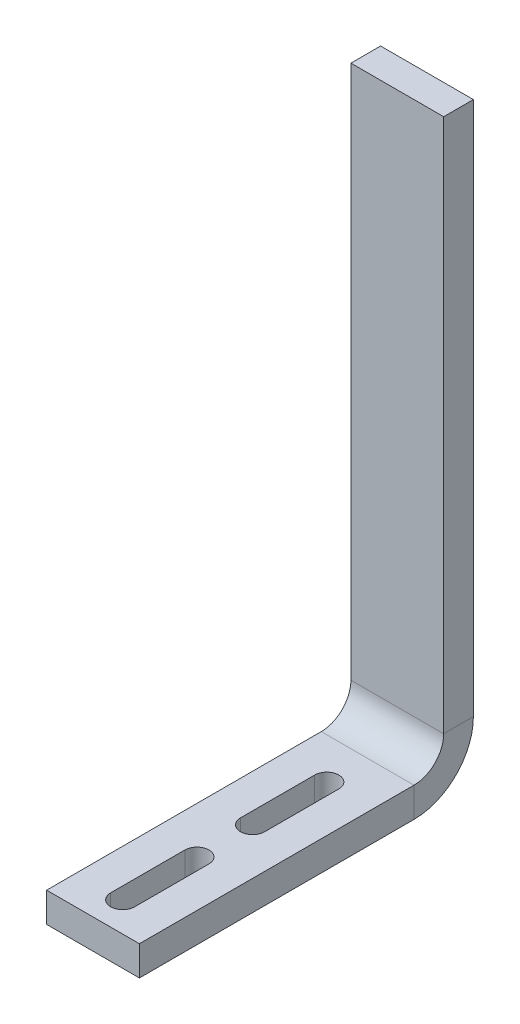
ISO-10303-21;
HEADER;
FILE_DESCRIPTION(('STEP AP214'),'2;1');
FILE_NAME('part.step','',(''),(''),'','','');
FILE_SCHEMA(('AUTOMOTIVE_DESIGN { 1 0 10303 214 1 1 1 1 }'));
ENDSEC;
DATA;
#1=APPLICATION_CONTEXT('core data for automotive mechanical design processes');
#2=APPLICATION_PROTOCOL_DEFINITION('international standard','automotive_design',2000,#1);
#3=PRODUCT_CONTEXT('',#1,'mechanical');
#4=PRODUCT('Part','Part','',(#3));
#5=PRODUCT_RELATED_PRODUCT_CATEGORY('part','',(#4));
#6=PRODUCT_DEFINITION_FORMATION('','',#4);
#7=PRODUCT_DEFINITION_CONTEXT('part definition',#1,'design');
#8=PRODUCT_DEFINITION('design','',#6,#7);
#9=PRODUCT_DEFINITION_SHAPE('','',#8);
#10=(LENGTH_UNIT() NAMED_UNIT(*) SI_UNIT(.MILLI.,.METRE.));
#11=(NAMED_UNIT(*) PLANE_ANGLE_UNIT() SI_UNIT($,.RADIAN.));
#12=(NAMED_UNIT(*) SI_UNIT($,.STERADIAN.) SOLID_ANGLE_UNIT());
#13=UNCERTAINTY_MEASURE_WITH_UNIT(LENGTH_MEASURE(1.E-05),#10,'distance_accuracy_value','');
#14=(GEOMETRIC_REPRESENTATION_CONTEXT(3) GLOBAL_UNCERTAINTY_ASSIGNED_CONTEXT((#13)) GLOBAL_UNIT_ASSIGNED_CONTEXT((#10,
#11,#12)) REPRESENTATION_CONTEXT('',''));
#15=CARTESIAN_POINT('',(0.,0.,0.));
#16=DIRECTION('',(0.,0.,1.));
#17=DIRECTION('',(1.,0.,0.));
#18=AXIS2_PLACEMENT_3D('',#15,#16,#17);
#19=CARTESIAN_POINT('',(12.5,0.,-74.));
#20=DIRECTION('',(1.,0.,0.));
#21=DIRECTION('',(0.,0.,-1.));
#22=AXIS2_PLACEMENT_3D('',#19,#20,#21);
#23=PLANE('',#22);
#24=DIRECTION('',(0.,1.,0.));
#25=VECTOR('',#24,1.);
#26=CARTESIAN_POINT('',(12.5,0.,-74.));
#27=LINE('',#26,#25);
#28=CARTESIAN_POINT('',(12.5,0.,-74.));
#29=VERTEX_POINT('',#28);
#30=CARTESIAN_POINT('',(12.5,8.00000000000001,-74.));
#31=VERTEX_POINT('',#30);
#32=EDGE_CURVE('E11',#29,#31,#27,.T.);
#33=ORIENTED_EDGE('',*,*,#32,.F.);
#34=CARTESIAN_POINT('',(12.5,16.,-74.));
#35=DIRECTION('',(-1.,0.,0.));
#36=DIRECTION('',(0.,0.,1.));
#37=AXIS2_PLACEMENT_3D('',#34,#35,#36);
#38=CIRCLE('',#37,16.);
#39=CARTESIAN_POINT('',(12.5,16.,-90.));
#40=VERTEX_POINT('',#39);
#41=EDGE_CURVE('E289',#29,#40,#38,.F.);
#42=ORIENTED_EDGE('',*,*,#41,.T.);
#43=DIRECTION('',(0.,0.,-1.));
#44=VECTOR('',#43,1.);
#45=CARTESIAN_POINT('',(12.5,16.,-82.));
#46=LINE('',#45,#44);
#47=CARTESIAN_POINT('',(12.5,16.,-82.));
#48=VERTEX_POINT('',#47);
#49=EDGE_CURVE('E52',#48,#40,#46,.T.);
#50=ORIENTED_EDGE('',*,*,#49,.F.);
#51=CARTESIAN_POINT('',(12.5,16.,-74.));
#52=DIRECTION('',(1.,0.,0.));
#53=DIRECTION('',(0.,0.,-1.));
#54=AXIS2_PLACEMENT_3D('',#51,#52,#53);
#55=CIRCLE('',#54,8.);
#56=EDGE_CURVE('E273',#31,#48,#55,.T.);
#57=ORIENTED_EDGE('',*,*,#56,.F.);
#58=EDGE_LOOP('',(#33,#42,#50,#57));
#59=FACE_BOUND('',#58,.T.);
#60=ADVANCED_FACE('F44',(#59),#23,.T.);
#61=CARTESIAN_POINT('',(12.5,16.,-82.));
#62=DIRECTION('',(1.,0.,0.));
#63=DIRECTION('',(0.,0.,-1.));
#64=AXIS2_PLACEMENT_3D('',#61,#62,#63);
#65=PLANE('',#64);
#66=DIRECTION('',(0.,0.,-1.));
#67=VECTOR('',#66,1.);
#68=CARTESIAN_POINT('',(12.5,0.,0.));
#69=LINE('',#68,#67);
#70=CARTESIAN_POINT('',(12.5,0.,0.));
#71=VERTEX_POINT('',#70);
#72=EDGE_CURVE('E285',#71,#29,#69,.T.);
#73=ORIENTED_EDGE('',*,*,#72,.T.);
#74=ORIENTED_EDGE('',*,*,#32,.T.);
#75=DIRECTION('',(0.,0.,-1.));
#76=VECTOR('',#75,1.);
#77=CARTESIAN_POINT('',(12.5,8.00000000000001,0.));
#78=LINE('',#77,#76);
#79=CARTESIAN_POINT('',(12.5,8.00000000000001,0.));
#80=VERTEX_POINT('',#79);
#81=EDGE_CURVE('E277',#80,#31,#78,.T.);
#82=ORIENTED_EDGE('',*,*,#81,.F.);
#83=DIRECTION('',(0.,1.,0.));
#84=VECTOR('',#83,1.);
#85=CARTESIAN_POINT('',(12.5,0.,0.));
#86=LINE('',#85,#84);
#87=EDGE_CURVE('E281',#71,#80,#86,.T.);
#88=ORIENTED_EDGE('',*,*,#87,.F.);
#89=EDGE_LOOP('',(#73,#74,#82,#88));
#90=FACE_BOUND('',#89,.T.);
#91=ADVANCED_FACE('F358',(#90),#65,.T.);
#92=CARTESIAN_POINT('',(-12.5,16.,-90.));
#93=DIRECTION('',(-1.,0.,0.));
#94=DIRECTION('',(0.,0.,1.));
#95=AXIS2_PLACEMENT_3D('',#92,#93,#94);
#96=PLANE('',#95);
#97=DIRECTION('',(0.,0.,1.));
#98=VECTOR('',#97,1.);
#99=CARTESIAN_POINT('',(-12.5,16.,-90.));
#100=LINE('',#99,#98);
#101=CARTESIAN_POINT('',(-12.5,16.,-90.));
#102=VERTEX_POINT('',#101);
#103=CARTESIAN_POINT('',(-12.5,16.,-82.));
#104=VERTEX_POINT('',#103);
#105=EDGE_CURVE('E323',#102,#104,#100,.T.);
#106=ORIENTED_EDGE('',*,*,#105,.F.);
#107=CARTESIAN_POINT('',(-12.5,16.,-74.));
#108=DIRECTION('',(-1.,0.,0.));
#109=DIRECTION('',(0.,0.,1.));
#110=AXIS2_PLACEMENT_3D('',#107,#108,#109);
#111=CIRCLE('',#110,16.);
#112=CARTESIAN_POINT('',(-12.5,0.,-74.));
#113=VERTEX_POINT('',#112);
#114=EDGE_CURVE('E258',#113,#102,#111,.F.);
#115=ORIENTED_EDGE('',*,*,#114,.F.);
#116=DIRECTION('',(0.,-1.,0.));
#117=VECTOR('',#116,1.);
#118=CARTESIAN_POINT('',(-12.5,8.00000000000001,-74.));
#119=LINE('',#118,#117);
#120=CARTESIAN_POINT('',(-12.5,8.00000000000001,-74.));
#121=VERTEX_POINT('',#120);
#122=EDGE_CURVE('E320',#121,#113,#119,.T.);
#123=ORIENTED_EDGE('',*,*,#122,.F.);
#124=CARTESIAN_POINT('',(-12.5,16.,-74.));
#125=DIRECTION('',(1.,0.,0.));
#126=DIRECTION('',(0.,0.,-1.));
#127=AXIS2_PLACEMENT_3D('',#124,#125,#126);
#128=CIRCLE('',#127,8.);
#129=EDGE_CURVE('E242',#121,#104,#128,.T.);
#130=ORIENTED_EDGE('',*,*,#129,.T.);
#131=EDGE_LOOP('',(#106,#115,#123,#130));
#132=FACE_BOUND('',#131,.T.);
#133=ADVANCED_FACE('F368',(#132),#96,.T.);
#134=CARTESIAN_POINT('',(-12.5,8.00000000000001,-74.));
#135=DIRECTION('',(-1.,0.,0.));
#136=DIRECTION('',(0.,0.,1.));
#137=AXIS2_PLACEMENT_3D('',#134,#135,#136);
#138=PLANE('',#137);
#139=DIRECTION('',(0.,1.,0.));
#140=VECTOR('',#139,1.);
#141=CARTESIAN_POINT('',(-12.5,0.,-90.));
#142=LINE('',#141,#140);
#143=CARTESIAN_POINT('',(-12.5,160.,-90.));
#144=VERTEX_POINT('',#143);
#145=EDGE_CURVE('E230',#102,#144,#142,.T.);
#146=ORIENTED_EDGE('',*,*,#145,.F.);
#147=ORIENTED_EDGE('',*,*,#105,.T.);
#148=DIRECTION('',(0.,1.,0.));
#149=VECTOR('',#148,1.);
#150=CARTESIAN_POINT('',(-12.5,0.,-82.));
#151=LINE('',#150,#149);
#152=CARTESIAN_POINT('',(-12.5,160.,-82.));
#153=VERTEX_POINT('',#152);
#154=EDGE_CURVE('E238',#104,#153,#151,.T.);
#155=ORIENTED_EDGE('',*,*,#154,.T.);
#156=DIRECTION('',(0.,0.,-1.));
#157=VECTOR('',#156,1.);
#158=CARTESIAN_POINT('',(-12.5,160.,-82.));
#159=LINE('',#158,#157);
#160=EDGE_CURVE('E234',#153,#144,#159,.T.);
#161=ORIENTED_EDGE('',*,*,#160,.T.);
#162=EDGE_LOOP('',(#146,#147,#155,#161));
#163=FACE_BOUND('',#162,.T.);
#164=ADVANCED_FACE('F370',(#163),#138,.T.);
#165=CARTESIAN_POINT('',(12.5,0.,-90.));
#166=DIRECTION('',(0.,0.,1.));
#167=DIRECTION('',(1.,0.,0.));
#168=AXIS2_PLACEMENT_3D('',#165,#166,#167);
#169=PLANE('',#168);
#170=ORIENTED_EDGE('',*,*,#145,.T.);
#171=DIRECTION('',(-1.,0.,0.));
#172=VECTOR('',#171,1.);
#173=CARTESIAN_POINT('',(12.5,160.,-90.));
#174=LINE('',#173,#172);
#175=CARTESIAN_POINT('',(12.5,160.,-90.));
#176=VERTEX_POINT('',#175);
#177=EDGE_CURVE('E317',#176,#144,#174,.T.);
#178=ORIENTED_EDGE('',*,*,#177,.F.);
#179=DIRECTION('',(0.,1.,0.));
#180=VECTOR('',#179,1.);
#181=CARTESIAN_POINT('',(12.5,0.,-90.));
#182=LINE('',#181,#180);
#183=EDGE_CURVE('E262',#40,#176,#182,.T.);
#184=ORIENTED_EDGE('',*,*,#183,.F.);
#185=DIRECTION('',(-1.,0.,0.));
#186=VECTOR('',#185,1.);
#187=CARTESIAN_POINT('',(12.5,16.,-90.));
#188=LINE('',#187,#186);
#189=EDGE_CURVE('E292',#40,#102,#188,.T.);
#190=ORIENTED_EDGE('',*,*,#189,.T.);
#191=EDGE_LOOP('',(#170,#178,#184,#190));
#192=FACE_BOUND('',#191,.T.);
#193=ADVANCED_FACE('F342',(#192),#169,.F.);
#194=CARTESIAN_POINT('',(12.5,160.,-82.));
#195=DIRECTION('',(0.,1.,0.));
#196=DIRECTION('',(0.,0.,1.));
#197=AXIS2_PLACEMENT_3D('',#194,#195,#196);
#198=PLANE('',#197);
#199=ORIENTED_EDGE('',*,*,#160,.F.);
#200=DIRECTION('',(-1.,0.,0.));
#201=VECTOR('',#200,1.);
#202=CARTESIAN_POINT('',(12.5,160.,-82.));
#203=LINE('',#202,#201);
#204=CARTESIAN_POINT('',(12.5,160.,-82.));
#205=VERTEX_POINT('',#204);
#206=EDGE_CURVE('E314',#205,#153,#203,.T.);
#207=ORIENTED_EDGE('',*,*,#206,.F.);
#208=DIRECTION('',(0.,0.,-1.));
#209=VECTOR('',#208,1.);
#210=CARTESIAN_POINT('',(12.5,160.,-82.));
#211=LINE('',#210,#209);
#212=EDGE_CURVE('E265',#205,#176,#211,.T.);
#213=ORIENTED_EDGE('',*,*,#212,.T.);
#214=ORIENTED_EDGE('',*,*,#177,.T.);
#215=EDGE_LOOP('',(#199,#207,#213,#214));
#216=FACE_BOUND('',#215,.T.);
#217=ADVANCED_FACE('F345',(#216),#198,.T.);
#218=CARTESIAN_POINT('',(12.5,0.,-82.));
#219=DIRECTION('',(0.,0.,1.));
#220=DIRECTION('',(1.,0.,0.));
#221=AXIS2_PLACEMENT_3D('',#218,#219,#220);
#222=PLANE('',#221);
#223=ORIENTED_EDGE('',*,*,#154,.F.);
#224=DIRECTION('',(-1.,0.,0.));
#225=VECTOR('',#224,1.);
#226=CARTESIAN_POINT('',(12.5,16.,-82.));
#227=LINE('',#226,#225);
#228=EDGE_CURVE('E310',#48,#104,#227,.T.);
#229=ORIENTED_EDGE('',*,*,#228,.F.);
#230=DIRECTION('',(0.,1.,0.));
#231=VECTOR('',#230,1.);
#232=CARTESIAN_POINT('',(12.5,0.,-82.));
#233=LINE('',#232,#231);
#234=EDGE_CURVE('E269',#48,#205,#233,.T.);
#235=ORIENTED_EDGE('',*,*,#234,.T.);
#236=ORIENTED_EDGE('',*,*,#206,.T.);
#237=EDGE_LOOP('',(#223,#229,#235,#236));
#238=FACE_BOUND('',#237,.T.);
#239=ADVANCED_FACE('F348',(#238),#222,.T.);
#240=CARTESIAN_POINT('',(12.5,16.,-74.));
#241=DIRECTION('',(-1.,0.,0.));
#242=DIRECTION('',(0.,0.,1.));
#243=AXIS2_PLACEMENT_3D('',#240,#241,#242);
#244=CYLINDRICAL_SURFACE('',#243,8.);
#245=ORIENTED_EDGE('',*,*,#129,.F.);
#246=DIRECTION('',(-1.,0.,0.));
#247=VECTOR('',#246,1.);
#248=CARTESIAN_POINT('',(12.5,8.00000000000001,-74.));
#249=LINE('',#248,#247);
#250=EDGE_CURVE('E306',#31,#121,#249,.T.);
#251=ORIENTED_EDGE('',*,*,#250,.F.);
#252=ORIENTED_EDGE('',*,*,#56,.T.);
#253=ORIENTED_EDGE('',*,*,#228,.T.);
#254=EDGE_LOOP('',(#245,#251,#252,#253));
#255=FACE_BOUND('',#254,.T.);
#256=ADVANCED_FACE('F351',(#255),#244,.F.);
#257=CARTESIAN_POINT('',(12.5,8.00000000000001,0.));
#258=DIRECTION('',(0.,1.,0.));
#259=DIRECTION('',(0.,0.,1.));
#260=AXIS2_PLACEMENT_3D('',#257,#258,#259);
#261=PLANE('',#260);
#262=CARTESIAN_POINT('',(0.,8.00000000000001,-43.));
#263=DIRECTION('',(0.,1.,0.));
#264=DIRECTION('',(0.,0.,1.));
#265=AXIS2_PLACEMENT_3D('',#262,#263,#264);
#266=CIRCLE('',#265,3.25);
#267=CARTESIAN_POINT('',(-3.24999999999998,8.00000000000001,-43.));
#268=VERTEX_POINT('',#267);
#269=CARTESIAN_POINT('',(3.24999999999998,8.00000000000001,-43.));
#270=VERTEX_POINT('',#269);
#271=EDGE_CURVE('E170',#268,#270,#266,.T.);
#272=ORIENTED_EDGE('',*,*,#271,.F.);
#273=DIRECTION('',(0.,0.,1.));
#274=VECTOR('',#273,1.);
#275=CARTESIAN_POINT('',(-3.24999999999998,8.00000000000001,-35.));
#276=LINE('',#275,#274);
#277=CARTESIAN_POINT('',(-3.24999999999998,8.00000000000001,-63.0000000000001));
#278=VERTEX_POINT('',#277);
#279=EDGE_CURVE('E158',#278,#268,#276,.T.);
#280=ORIENTED_EDGE('',*,*,#279,.F.);
#281=CARTESIAN_POINT('',(0.,8.00000000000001,-63.));
#282=DIRECTION('',(0.,1.,0.));
#283=DIRECTION('',(0.,0.,1.));
#284=AXIS2_PLACEMENT_3D('',#281,#282,#283);
#285=CIRCLE('',#284,3.25);
#286=CARTESIAN_POINT('',(3.24999999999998,8.00000000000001,-63.));
#287=VERTEX_POINT('',#286);
#288=EDGE_CURVE('E59',#287,#278,#285,.T.);
#289=ORIENTED_EDGE('',*,*,#288,.F.);
#290=DIRECTION('',(0.,0.,-1.));
#291=VECTOR('',#290,1.);
#292=CARTESIAN_POINT('',(3.24999999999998,8.00000000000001,-35.));
#293=LINE('',#292,#291);
#294=EDGE_CURVE('E177',#270,#287,#293,.T.);
#295=ORIENTED_EDGE('',*,*,#294,.F.);
#296=EDGE_LOOP('',(#272,#280,#289,#295));
#297=FACE_BOUND('',#296,.T.);
#298=CARTESIAN_POINT('',(0.,8.00000000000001,-8.00000000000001));
#299=DIRECTION('',(0.,1.,0.));
#300=DIRECTION('',(0.,0.,1.));
#301=AXIS2_PLACEMENT_3D('',#298,#299,#300);
#302=CIRCLE('',#301,3.25);
#303=CARTESIAN_POINT('',(-3.24999999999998,8.00000000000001,-8.00000000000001));
#304=VERTEX_POINT('',#303);
#305=CARTESIAN_POINT('',(3.24999999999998,8.00000000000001,-8.00000000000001));
#306=VERTEX_POINT('',#305);
#307=EDGE_CURVE('E227',#304,#306,#302,.T.);
#308=ORIENTED_EDGE('',*,*,#307,.F.);
#309=DIRECTION('',(0.,0.,1.));
#310=VECTOR('',#309,1.);
#311=CARTESIAN_POINT('',(-3.24999999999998,8.00000000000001,0.));
#312=LINE('',#311,#310);
#313=CARTESIAN_POINT('',(-3.24999999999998,8.00000000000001,-28.));
#314=VERTEX_POINT('',#313);
#315=EDGE_CURVE('E208',#314,#304,#312,.T.);
#316=ORIENTED_EDGE('',*,*,#315,.F.);
#317=CARTESIAN_POINT('',(0.,8.00000000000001,-28.));
#318=DIRECTION('',(0.,1.,0.));
#319=DIRECTION('',(0.,0.,1.));
#320=AXIS2_PLACEMENT_3D('',#317,#318,#319);
#321=CIRCLE('',#320,3.25);
#322=CARTESIAN_POINT('',(3.24999999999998,8.00000000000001,-28.));
#323=VERTEX_POINT('',#322);
#324=EDGE_CURVE('E220',#323,#314,#321,.T.);
#325=ORIENTED_EDGE('',*,*,#324,.F.);
#326=DIRECTION('',(0.,0.,-1.));
#327=VECTOR('',#326,1.);
#328=CARTESIAN_POINT('',(3.24999999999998,8.00000000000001,0.));
#329=LINE('',#328,#327);
#330=EDGE_CURVE('E224',#306,#323,#329,.T.);
#331=ORIENTED_EDGE('',*,*,#330,.F.);
#332=EDGE_LOOP('',(#308,#316,#325,#331));
#333=FACE_BOUND('',#332,.T.);
#334=DIRECTION('',(0.,0.,-1.));
#335=VECTOR('',#334,1.);
#336=CARTESIAN_POINT('',(-12.5,8.00000000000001,0.));
#337=LINE('',#336,#335);
#338=CARTESIAN_POINT('',(-12.5,8.00000000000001,0.));
#339=VERTEX_POINT('',#338);
#340=EDGE_CURVE('E246',#339,#121,#337,.T.);
#341=ORIENTED_EDGE('',*,*,#340,.F.);
#342=DIRECTION('',(-1.,0.,0.));
#343=VECTOR('',#342,1.);
#344=CARTESIAN_POINT('',(12.5,8.00000000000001,0.));
#345=LINE('',#344,#343);
#346=EDGE_CURVE('E303',#80,#339,#345,.T.);
#347=ORIENTED_EDGE('',*,*,#346,.F.);
#348=ORIENTED_EDGE('',*,*,#81,.T.);
#349=ORIENTED_EDGE('',*,*,#250,.T.);
#350=EDGE_LOOP('',(#341,#347,#348,#349));
#351=FACE_BOUND('',#350,.T.);
#352=ADVANCED_FACE('F174',(#297,#333,#351),#261,.T.);
#353=CARTESIAN_POINT('',(12.5,0.,0.));
#354=DIRECTION('',(0.,0.,1.));
#355=DIRECTION('',(1.,0.,0.));
#356=AXIS2_PLACEMENT_3D('',#353,#354,#355);
#357=PLANE('',#356);
#358=DIRECTION('',(0.,1.,0.));
#359=VECTOR('',#358,1.);
#360=CARTESIAN_POINT('',(-12.5,0.,0.));
#361=LINE('',#360,#359);
#362=CARTESIAN_POINT('',(-12.5,0.,0.));
#363=VERTEX_POINT('',#362);
#364=EDGE_CURVE('E250',#363,#339,#361,.T.);
#365=ORIENTED_EDGE('',*,*,#364,.F.);
#366=DIRECTION('',(-1.,0.,0.));
#367=VECTOR('',#366,1.);
#368=CARTESIAN_POINT('',(12.5,0.,0.));
#369=LINE('',#368,#367);
#370=EDGE_CURVE('E300',#71,#363,#369,.T.);
#371=ORIENTED_EDGE('',*,*,#370,.F.);
#372=ORIENTED_EDGE('',*,*,#87,.T.);
#373=ORIENTED_EDGE('',*,*,#346,.T.);
#374=EDGE_LOOP('',(#365,#371,#372,#373));
#375=FACE_BOUND('',#374,.T.);
#376=ADVANCED_FACE('F361',(#375),#357,.T.);
#377=CARTESIAN_POINT('',(12.5,0.,0.));
#378=DIRECTION('',(0.,1.,0.));
#379=DIRECTION('',(0.,0.,1.));
#380=AXIS2_PLACEMENT_3D('',#377,#378,#379);
#381=PLANE('',#380);
#382=DIRECTION('',(0.,0.,-1.));
#383=VECTOR('',#382,1.);
#384=CARTESIAN_POINT('',(-3.24999999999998,0.,-43.));
#385=LINE('',#384,#383);
#386=CARTESIAN_POINT('',(-3.24999999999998,0.,-43.));
#387=VERTEX_POINT('',#386);
#388=CARTESIAN_POINT('',(-3.24999999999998,0.,-63.0000000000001));
#389=VERTEX_POINT('',#388);
#390=EDGE_CURVE('E166',#387,#389,#385,.T.);
#391=ORIENTED_EDGE('',*,*,#390,.F.);
#392=CARTESIAN_POINT('',(0.,0.,-43.));
#393=DIRECTION('',(0.,-1.,0.));
#394=DIRECTION('',(0.,0.,1.));
#395=AXIS2_PLACEMENT_3D('',#392,#393,#394);
#396=CIRCLE('',#395,3.25);
#397=CARTESIAN_POINT('',(3.24999999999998,0.,-43.));
#398=VERTEX_POINT('',#397);
#399=EDGE_CURVE('E67',#398,#387,#396,.T.);
#400=ORIENTED_EDGE('',*,*,#399,.F.);
#401=DIRECTION('',(0.,0.,1.));
#402=VECTOR('',#401,1.);
#403=CARTESIAN_POINT('',(3.24999999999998,0.,-43.));
#404=LINE('',#403,#402);
#405=CARTESIAN_POINT('',(3.24999999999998,0.,-63.));
#406=VERTEX_POINT('',#405);
#407=EDGE_CURVE('E187',#406,#398,#404,.T.);
#408=ORIENTED_EDGE('',*,*,#407,.F.);
#409=CARTESIAN_POINT('',(0.,0.,-63.));
#410=DIRECTION('',(0.,-1.,0.));
#411=DIRECTION('',(0.,0.,-1.));
#412=AXIS2_PLACEMENT_3D('',#409,#410,#411);
#413=CIRCLE('',#412,3.25);
#414=EDGE_CURVE('E631',#389,#406,#413,.T.);
#415=ORIENTED_EDGE('',*,*,#414,.F.);
#416=EDGE_LOOP('',(#391,#400,#408,#415));
#417=FACE_BOUND('',#416,.T.);
#418=DIRECTION('',(0.,0.,-1.));
#419=VECTOR('',#418,1.);
#420=CARTESIAN_POINT('',(-3.24999999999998,0.,-8.00000000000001));
#421=LINE('',#420,#419);
#422=CARTESIAN_POINT('',(-3.24999999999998,0.,-8.00000000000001));
#423=VERTEX_POINT('',#422);
#424=CARTESIAN_POINT('',(-3.24999999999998,0.,-28.));
#425=VERTEX_POINT('',#424);
#426=EDGE_CURVE('E192',#423,#425,#421,.T.);
#427=ORIENTED_EDGE('',*,*,#426,.F.);
#428=CARTESIAN_POINT('',(0.,0.,-8.00000000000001));
#429=DIRECTION('',(0.,-1.,0.));
#430=DIRECTION('',(0.,0.,1.));
#431=AXIS2_PLACEMENT_3D('',#428,#429,#430);
#432=CIRCLE('',#431,3.25);
#433=CARTESIAN_POINT('',(3.24999999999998,0.,-8.00000000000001));
#434=VERTEX_POINT('',#433);
#435=EDGE_CURVE('E184',#434,#423,#432,.T.);
#436=ORIENTED_EDGE('',*,*,#435,.F.);
#437=DIRECTION('',(0.,0.,1.));
#438=VECTOR('',#437,1.);
#439=CARTESIAN_POINT('',(3.24999999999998,0.,-8.00000000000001));
#440=LINE('',#439,#438);
#441=CARTESIAN_POINT('',(3.24999999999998,0.,-28.));
#442=VERTEX_POINT('',#441);
#443=EDGE_CURVE('E200',#442,#434,#440,.T.);
#444=ORIENTED_EDGE('',*,*,#443,.F.);
#445=CARTESIAN_POINT('',(0.,0.,-28.));
#446=DIRECTION('',(0.,-1.,0.));
#447=DIRECTION('',(0.,0.,-1.));
#448=AXIS2_PLACEMENT_3D('',#445,#446,#447);
#449=CIRCLE('',#448,3.25);
#450=EDGE_CURVE('E196',#425,#442,#449,.T.);
#451=ORIENTED_EDGE('',*,*,#450,.F.);
#452=EDGE_LOOP('',(#427,#436,#444,#451));
#453=FACE_BOUND('',#452,.T.);
#454=DIRECTION('',(0.,0.,-1.));
#455=VECTOR('',#454,1.);
#456=CARTESIAN_POINT('',(-12.5,0.,0.));
#457=LINE('',#456,#455);
#458=EDGE_CURVE('E254',#363,#113,#457,.T.);
#459=ORIENTED_EDGE('',*,*,#458,.T.);
#460=DIRECTION('',(-1.,0.,0.));
#461=VECTOR('',#460,1.);
#462=CARTESIAN_POINT('',(12.5,0.,-74.));
#463=LINE('',#462,#461);
#464=EDGE_CURVE('E296',#29,#113,#463,.T.);
#465=ORIENTED_EDGE('',*,*,#464,.F.);
#466=ORIENTED_EDGE('',*,*,#72,.F.);
#467=ORIENTED_EDGE('',*,*,#370,.T.);
#468=EDGE_LOOP('',(#459,#465,#466,#467));
#469=FACE_BOUND('',#468,.T.);
#470=ADVANCED_FACE('F366',(#417,#453,#469),#381,.F.);
#471=CARTESIAN_POINT('',(12.5,16.,-74.));
#472=DIRECTION('',(-1.,0.,0.));
#473=DIRECTION('',(0.,0.,1.));
#474=AXIS2_PLACEMENT_3D('',#471,#472,#473);
#475=CYLINDRICAL_SURFACE('',#474,16.);
#476=ORIENTED_EDGE('',*,*,#114,.T.);
#477=ORIENTED_EDGE('',*,*,#189,.F.);
#478=ORIENTED_EDGE('',*,*,#41,.F.);
#479=ORIENTED_EDGE('',*,*,#464,.T.);
#480=EDGE_LOOP('',(#476,#477,#478,#479));
#481=FACE_BOUND('',#480,.T.);
#482=ADVANCED_FACE('F338',(#481),#475,.T.);
#483=CARTESIAN_POINT('',(12.5,16.,-74.));
#484=DIRECTION('',(1.,0.,0.));
#485=DIRECTION('',(0.,0.,-1.));
#486=AXIS2_PLACEMENT_3D('',#483,#484,#485);
#487=PLANE('',#486);
#488=ORIENTED_EDGE('',*,*,#183,.T.);
#489=ORIENTED_EDGE('',*,*,#212,.F.);
#490=ORIENTED_EDGE('',*,*,#234,.F.);
#491=ORIENTED_EDGE('',*,*,#49,.T.);
#492=EDGE_LOOP('',(#488,#489,#490,#491));
#493=FACE_BOUND('',#492,.T.);
#494=ADVANCED_FACE('F328',(#493),#487,.T.);
#495=CARTESIAN_POINT('',(-12.5,16.,-74.));
#496=DIRECTION('',(1.,0.,0.));
#497=DIRECTION('',(0.,0.,-1.));
#498=AXIS2_PLACEMENT_3D('',#495,#496,#497);
#499=PLANE('',#498);
#500=ORIENTED_EDGE('',*,*,#340,.T.);
#501=ORIENTED_EDGE('',*,*,#122,.T.);
#502=ORIENTED_EDGE('',*,*,#458,.F.);
#503=ORIENTED_EDGE('',*,*,#364,.T.);
#504=EDGE_LOOP('',(#500,#501,#502,#503));
#505=FACE_BOUND('',#504,.T.);
#506=ADVANCED_FACE('F455',(#505),#499,.F.);
#507=CARTESIAN_POINT('',(0.,160.,-8.00000000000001));
#508=DIRECTION('',(0.,-1.,0.));
#509=DIRECTION('',(0.,0.,-1.));
#510=AXIS2_PLACEMENT_3D('',#507,#508,#509);
#511=CYLINDRICAL_SURFACE('',#510,3.25);
#512=ORIENTED_EDGE('',*,*,#307,.T.);
#513=DIRECTION('',(0.,-1.,0.));
#514=VECTOR('',#513,1.);
#515=CARTESIAN_POINT('',(3.24999999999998,160.,-8.00000000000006));
#516=LINE('',#515,#514);
#517=EDGE_CURVE('E205',#306,#434,#516,.T.);
#518=ORIENTED_EDGE('',*,*,#517,.T.);
#519=ORIENTED_EDGE('',*,*,#435,.T.);
#520=DIRECTION('',(0.,-1.,0.));
#521=VECTOR('',#520,1.);
#522=CARTESIAN_POINT('',(-3.24999999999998,160.,-8.00000000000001));
#523=LINE('',#522,#521);
#524=EDGE_CURVE('E204',#304,#423,#523,.T.);
#525=ORIENTED_EDGE('',*,*,#524,.F.);
#526=EDGE_LOOP('',(#512,#518,#519,#525));
#527=FACE_BOUND('',#526,.T.);
#528=ADVANCED_FACE('F463',(#527),#511,.F.);
#529=CARTESIAN_POINT('',(3.24999999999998,160.,-8.00000000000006));
#530=DIRECTION('',(1.,0.,0.));
#531=DIRECTION('',(0.,0.,-1.));
#532=AXIS2_PLACEMENT_3D('',#529,#530,#531);
#533=PLANE('',#532);
#534=ORIENTED_EDGE('',*,*,#330,.T.);
#535=DIRECTION('',(0.,-1.,0.));
#536=VECTOR('',#535,1.);
#537=CARTESIAN_POINT('',(3.24999999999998,160.,-28.));
#538=LINE('',#537,#536);
#539=EDGE_CURVE('E209',#323,#442,#538,.T.);
#540=ORIENTED_EDGE('',*,*,#539,.T.);
#541=ORIENTED_EDGE('',*,*,#443,.T.);
#542=ORIENTED_EDGE('',*,*,#517,.F.);
#543=EDGE_LOOP('',(#534,#540,#541,#542));
#544=FACE_BOUND('',#543,.T.);
#545=ADVANCED_FACE('F472',(#544),#533,.F.);
#546=CARTESIAN_POINT('',(0.,160.,-28.));
#547=DIRECTION('',(0.,-1.,0.));
#548=DIRECTION('',(0.,0.,-1.));
#549=AXIS2_PLACEMENT_3D('',#546,#547,#548);
#550=CYLINDRICAL_SURFACE('',#549,3.25);
#551=ORIENTED_EDGE('',*,*,#324,.T.);
#552=DIRECTION('',(0.,-1.,0.));
#553=VECTOR('',#552,1.);
#554=CARTESIAN_POINT('',(-3.24999999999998,160.,-28.));
#555=LINE('',#554,#553);
#556=EDGE_CURVE('E212',#314,#425,#555,.T.);
#557=ORIENTED_EDGE('',*,*,#556,.T.);
#558=ORIENTED_EDGE('',*,*,#450,.T.);
#559=ORIENTED_EDGE('',*,*,#539,.F.);
#560=EDGE_LOOP('',(#551,#557,#558,#559));
#561=FACE_BOUND('',#560,.T.);
#562=ADVANCED_FACE('F481',(#561),#550,.F.);
#563=CARTESIAN_POINT('',(-3.24999999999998,160.,-8.00000000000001));
#564=DIRECTION('',(-1.,0.,0.));
#565=DIRECTION('',(0.,0.,1.));
#566=AXIS2_PLACEMENT_3D('',#563,#564,#565);
#567=PLANE('',#566);
#568=ORIENTED_EDGE('',*,*,#315,.T.);
#569=ORIENTED_EDGE('',*,*,#524,.T.);
#570=ORIENTED_EDGE('',*,*,#426,.T.);
#571=ORIENTED_EDGE('',*,*,#556,.F.);
#572=EDGE_LOOP('',(#568,#569,#570,#571));
#573=FACE_BOUND('',#572,.T.);
#574=ADVANCED_FACE('F490',(#573),#567,.F.);
#575=CARTESIAN_POINT('',(0.,160.,-43.));
#576=DIRECTION('',(0.,-1.,0.));
#577=DIRECTION('',(0.,0.,-1.));
#578=AXIS2_PLACEMENT_3D('',#575,#576,#577);
#579=CYLINDRICAL_SURFACE('',#578,3.25);
#580=ORIENTED_EDGE('',*,*,#271,.T.);
#581=DIRECTION('',(0.,-1.,0.));
#582=VECTOR('',#581,1.);
#583=CARTESIAN_POINT('',(3.24999999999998,160.,-43.));
#584=LINE('',#583,#582);
#585=EDGE_CURVE('E179',#270,#398,#584,.T.);
#586=ORIENTED_EDGE('',*,*,#585,.T.);
#587=ORIENTED_EDGE('',*,*,#399,.T.);
#588=DIRECTION('',(0.,-1.,0.));
#589=VECTOR('',#588,1.);
#590=CARTESIAN_POINT('',(-3.24999999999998,160.,-43.));
#591=LINE('',#590,#589);
#592=EDGE_CURVE('E160',#268,#387,#591,.T.);
#593=ORIENTED_EDGE('',*,*,#592,.F.);
#594=EDGE_LOOP('',(#580,#586,#587,#593));
#595=FACE_BOUND('',#594,.T.);
#596=ADVANCED_FACE('F169',(#595),#579,.F.);
#597=CARTESIAN_POINT('',(3.24999999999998,160.,-43.));
#598=DIRECTION('',(1.,0.,0.));
#599=DIRECTION('',(0.,0.,-1.));
#600=AXIS2_PLACEMENT_3D('',#597,#598,#599);
#601=PLANE('',#600);
#602=ORIENTED_EDGE('',*,*,#294,.T.);
#603=DIRECTION('',(0.,-1.,0.));
#604=VECTOR('',#603,1.);
#605=CARTESIAN_POINT('',(3.24999999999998,160.,-63.));
#606=LINE('',#605,#604);
#607=EDGE_CURVE('E626',#287,#406,#606,.T.);
#608=ORIENTED_EDGE('',*,*,#607,.T.);
#609=ORIENTED_EDGE('',*,*,#407,.T.);
#610=ORIENTED_EDGE('',*,*,#585,.F.);
#611=EDGE_LOOP('',(#602,#608,#609,#610));
#612=FACE_BOUND('',#611,.T.);
#613=ADVANCED_FACE('F507',(#612),#601,.F.);
#614=CARTESIAN_POINT('',(0.,160.,-63.));
#615=DIRECTION('',(0.,-1.,0.));
#616=DIRECTION('',(0.,0.,-1.));
#617=AXIS2_PLACEMENT_3D('',#614,#615,#616);
#618=CYLINDRICAL_SURFACE('',#617,3.25);
#619=ORIENTED_EDGE('',*,*,#288,.T.);
#620=DIRECTION('',(0.,-1.,0.));
#621=VECTOR('',#620,1.);
#622=CARTESIAN_POINT('',(-3.24999999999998,160.,-63.));
#623=LINE('',#622,#621);
#624=EDGE_CURVE('E162',#278,#389,#623,.T.);
#625=ORIENTED_EDGE('',*,*,#624,.T.);
#626=ORIENTED_EDGE('',*,*,#414,.T.);
#627=ORIENTED_EDGE('',*,*,#607,.F.);
#628=EDGE_LOOP('',(#619,#625,#626,#627));
#629=FACE_BOUND('',#628,.T.);
#630=ADVANCED_FACE('F515',(#629),#618,.F.);
#631=CARTESIAN_POINT('',(-3.24999999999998,160.,-43.));
#632=DIRECTION('',(-1.,0.,0.));
#633=DIRECTION('',(0.,0.,1.));
#634=AXIS2_PLACEMENT_3D('',#631,#632,#633);
#635=PLANE('',#634);
#636=ORIENTED_EDGE('',*,*,#279,.T.);
#637=ORIENTED_EDGE('',*,*,#592,.T.);
#638=ORIENTED_EDGE('',*,*,#390,.T.);
#639=ORIENTED_EDGE('',*,*,#624,.F.);
#640=EDGE_LOOP('',(#636,#637,#638,#639));
#641=FACE_BOUND('',#640,.T.);
#642=ADVANCED_FACE('F159',(#641),#635,.F.);
#643=CLOSED_SHELL('',(#60,#91,#133,#164,#193,#217,#239,#256,#352,#376,#470,#482,#494,#506,#528,
#545,#562,#574,#596,#613,#630,#642));
#644=MANIFOLD_SOLID_BREP('B2',#643);
#645=ADVANCED_BREP_SHAPE_REPRESENTATION('',(#18,#644),#14);
#646=SHAPE_DEFINITION_REPRESENTATION(#9,#645);
ENDSEC;
END-ISO-10303-21;
